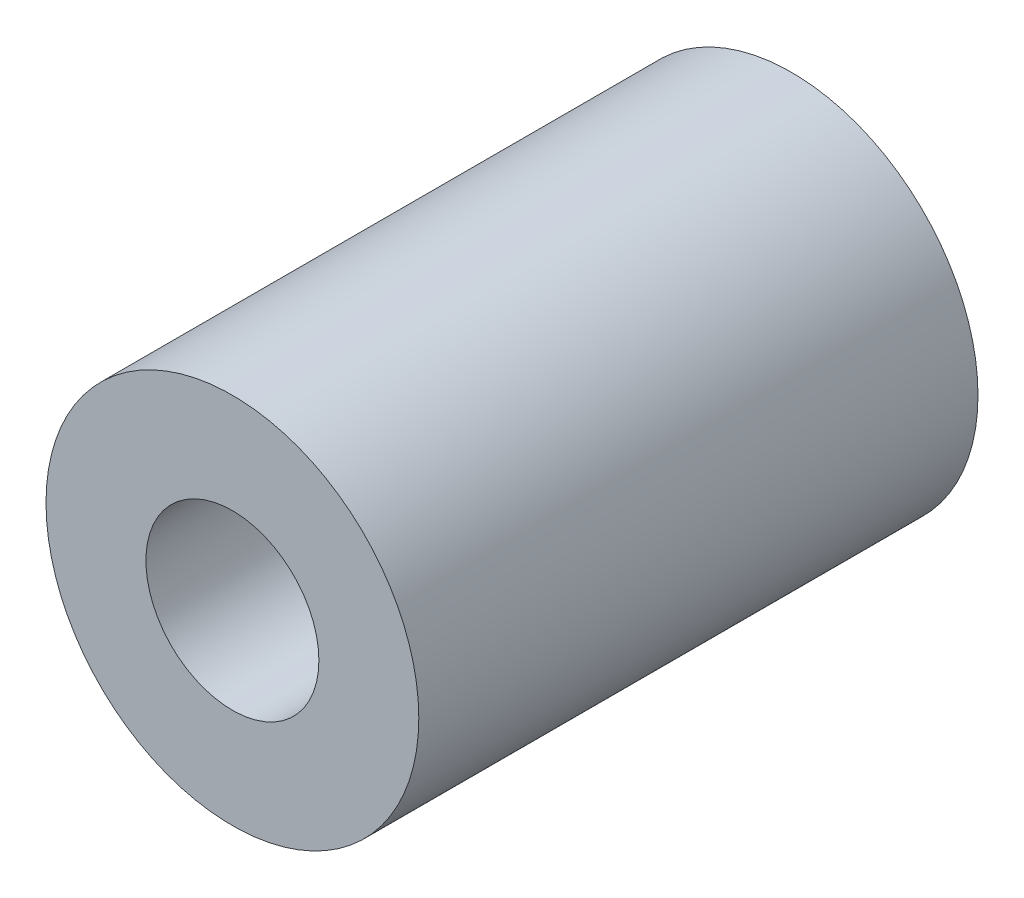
ISO-10303-21;
HEADER;
FILE_DESCRIPTION(('STEP AP214'),'2;1');
FILE_NAME('part.step','',(''),(''),'','','');
FILE_SCHEMA(('AUTOMOTIVE_DESIGN { 1 0 10303 214 1 1 1 1 }'));
ENDSEC;
DATA;
#1=APPLICATION_CONTEXT('core data for automotive mechanical design processes');
#2=APPLICATION_PROTOCOL_DEFINITION('international standard','automotive_design',2000,#1);
#3=PRODUCT_CONTEXT('',#1,'mechanical');
#4=PRODUCT('Part','Part','',(#3));
#5=PRODUCT_RELATED_PRODUCT_CATEGORY('part','',(#4));
#6=PRODUCT_DEFINITION_FORMATION('','',#4);
#7=PRODUCT_DEFINITION_CONTEXT('part definition',#1,'design');
#8=PRODUCT_DEFINITION('design','',#6,#7);
#9=PRODUCT_DEFINITION_SHAPE('','',#8);
#10=(LENGTH_UNIT() NAMED_UNIT(*) SI_UNIT(.MILLI.,.METRE.));
#11=(NAMED_UNIT(*) PLANE_ANGLE_UNIT() SI_UNIT($,.RADIAN.));
#12=(NAMED_UNIT(*) SI_UNIT($,.STERADIAN.) SOLID_ANGLE_UNIT());
#13=UNCERTAINTY_MEASURE_WITH_UNIT(LENGTH_MEASURE(1.E-05),#10,'distance_accuracy_value','');
#14=(GEOMETRIC_REPRESENTATION_CONTEXT(3) GLOBAL_UNCERTAINTY_ASSIGNED_CONTEXT((#13)) GLOBAL_UNIT_ASSIGNED_CONTEXT((#10,
#11,#12)) REPRESENTATION_CONTEXT('',''));
#15=CARTESIAN_POINT('',(0.,0.,0.));
#16=DIRECTION('',(0.,0.,1.));
#17=DIRECTION('',(1.,0.,0.));
#18=AXIS2_PLACEMENT_3D('',#15,#16,#17);
#19=CARTESIAN_POINT('',(0.,0.,9.525));
#20=DIRECTION('',(0.,0.,-1.));
#21=DIRECTION('',(-1.,0.,0.));
#22=AXIS2_PLACEMENT_3D('',#19,#20,#21);
#23=CYLINDRICAL_SURFACE('',#22,3.175);
#24=CARTESIAN_POINT('',(0.,0.,9.525));
#25=DIRECTION('',(0.,0.,1.));
#26=DIRECTION('',(1.,0.,0.));
#27=AXIS2_PLACEMENT_3D('',#24,#25,#26);
#28=CIRCLE('',#27,3.175);
#29=CARTESIAN_POINT('',(-3.175,0.,9.525));
#30=VERTEX_POINT('',#29);
#31=EDGE_CURVE('E10',#30,#30,#28,.T.);
#32=CARTESIAN_POINT('',(0.,0.,0.));
#33=DIRECTION('',(0.,0.,1.));
#34=DIRECTION('',(1.,0.,0.));
#35=AXIS2_PLACEMENT_3D('',#32,#33,#34);
#36=CIRCLE('',#35,3.175);
#37=CARTESIAN_POINT('',(-3.175,0.,0.));
#38=VERTEX_POINT('',#37);
#39=EDGE_CURVE('E34',#38,#38,#36,.T.);
#40=CARTESIAN_POINT('',(-3.175,0.,9.525));
#41=CARTESIAN_POINT('',(-3.175,0.,9.42578125));
#42=CARTESIAN_POINT('',(-3.175,0.,9.3265625));
#43=CARTESIAN_POINT('',(-3.175,0.,9.128125));
#44=CARTESIAN_POINT('',(-3.175,0.,9.02890625));
#45=CARTESIAN_POINT('',(-3.175,0.,8.83046875));
#46=CARTESIAN_POINT('',(-3.175,0.,8.73125));
#47=CARTESIAN_POINT('',(-3.175,0.,8.5328125));
#48=CARTESIAN_POINT('',(-3.175,0.,8.43359375));
#49=CARTESIAN_POINT('',(-3.175,0.,8.23515625));
#50=CARTESIAN_POINT('',(-3.175,0.,8.1359375));
#51=CARTESIAN_POINT('',(-3.175,0.,7.9375));
#52=CARTESIAN_POINT('',(-3.175,0.,7.83828125));
#53=CARTESIAN_POINT('',(-3.175,0.,7.63984375));
#54=CARTESIAN_POINT('',(-3.175,0.,7.540625));
#55=CARTESIAN_POINT('',(-3.175,0.,7.3421875));
#56=CARTESIAN_POINT('',(-3.175,0.,7.24296875));
#57=CARTESIAN_POINT('',(-3.175,0.,7.04453125));
#58=CARTESIAN_POINT('',(-3.175,0.,6.9453125));
#59=CARTESIAN_POINT('',(-3.175,0.,6.746875));
#60=CARTESIAN_POINT('',(-3.175,0.,6.64765625));
#61=CARTESIAN_POINT('',(-3.175,0.,6.44921875));
#62=CARTESIAN_POINT('',(-3.175,0.,6.35));
#63=CARTESIAN_POINT('',(-3.175,0.,6.1515625));
#64=CARTESIAN_POINT('',(-3.175,0.,6.05234375));
#65=CARTESIAN_POINT('',(-3.175,0.,5.85390625));
#66=CARTESIAN_POINT('',(-3.175,0.,5.7546875));
#67=CARTESIAN_POINT('',(-3.175,0.,5.55625));
#68=CARTESIAN_POINT('',(-3.175,0.,5.45703125));
#69=CARTESIAN_POINT('',(-3.175,0.,5.25859375));
#70=CARTESIAN_POINT('',(-3.175,0.,5.159375));
#71=CARTESIAN_POINT('',(-3.175,0.,4.9609375));
#72=CARTESIAN_POINT('',(-3.175,0.,4.86171875));
#73=CARTESIAN_POINT('',(-3.175,0.,4.66328125));
#74=CARTESIAN_POINT('',(-3.175,0.,4.5640625));
#75=CARTESIAN_POINT('',(-3.175,0.,4.365625));
#76=CARTESIAN_POINT('',(-3.175,0.,4.26640625));
#77=CARTESIAN_POINT('',(-3.175,0.,4.06796875));
#78=CARTESIAN_POINT('',(-3.175,0.,3.96875));
#79=CARTESIAN_POINT('',(-3.175,0.,3.7703125));
#80=CARTESIAN_POINT('',(-3.175,0.,3.67109375));
#81=CARTESIAN_POINT('',(-3.175,0.,3.47265625));
#82=CARTESIAN_POINT('',(-3.175,0.,3.3734375));
#83=CARTESIAN_POINT('',(-3.175,0.,3.175));
#84=CARTESIAN_POINT('',(-3.175,0.,3.07578125));
#85=CARTESIAN_POINT('',(-3.175,0.,2.87734375));
#86=CARTESIAN_POINT('',(-3.175,0.,2.778125));
#87=CARTESIAN_POINT('',(-3.175,0.,2.5796875));
#88=CARTESIAN_POINT('',(-3.175,0.,2.48046875));
#89=CARTESIAN_POINT('',(-3.175,0.,2.28203125));
#90=CARTESIAN_POINT('',(-3.175,0.,2.1828125));
#91=CARTESIAN_POINT('',(-3.175,0.,1.984375));
#92=CARTESIAN_POINT('',(-3.175,0.,1.88515625));
#93=CARTESIAN_POINT('',(-3.175,0.,1.68671875));
#94=CARTESIAN_POINT('',(-3.175,0.,1.5875));
#95=CARTESIAN_POINT('',(-3.175,0.,1.3890625));
#96=CARTESIAN_POINT('',(-3.175,0.,1.28984375));
#97=CARTESIAN_POINT('',(-3.175,0.,1.09140625));
#98=CARTESIAN_POINT('',(-3.175,0.,0.992187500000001));
#99=CARTESIAN_POINT('',(-3.175,0.,0.793750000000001));
#100=CARTESIAN_POINT('',(-3.175,0.,0.69453125));
#101=CARTESIAN_POINT('',(-3.175,0.,0.49609375));
#102=CARTESIAN_POINT('',(-3.175,0.,0.396875));
#103=CARTESIAN_POINT('',(-3.175,0.,0.1984375));
#104=CARTESIAN_POINT('',(-3.175,0.,0.0992187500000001));
#105=CARTESIAN_POINT('',(-3.175,0.,0.));
#106=B_SPLINE_CURVE_WITH_KNOTS('',3,(#40,#41,#42,#43,#44,#45,#46,#47,#48,#49,#50,#51,#52,#53,
#54,#55,#56,#57,#58,#59,#60,#61,#62,#63,#64,#65,#66,#67,#68,#69,#70,#71,#72,#73,#74,#75,#76,#77,
#78,#79,#80,#81,#82,#83,#84,#85,#86,#87,#88,#89,#90,#91,#92,#93,#94,#95,#96,#97,#98,#99,#100,
#101,#102,#103,#104,#105),.UNSPECIFIED.,.F.,.F.,(4,2,2,2,2,2,2,2,2,2,2,2,2,2,2,2,2,2,2,2,2,2,2,
2,2,2,2,2,2,2,2,2,4),(0.,0.29765625,0.5953125,0.892968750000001,1.190625,1.48828125,1.7859375,
2.08359375,2.38125,2.67890625,2.9765625,3.27421875,3.571875,3.86953125,4.1671875,4.46484375,
4.7625,5.06015625,5.3578125,5.65546875,5.953125,6.25078125,6.5484375,6.84609375,7.14375,
7.44140625,7.7390625,8.03671875,8.334375,8.63203125,8.9296875,9.22734375,9.525),.UNSPECIFIED.);
#107=EDGE_CURVE('BSEAM31',#30,#38,#106,.T.);
#108=ORIENTED_EDGE('',*,*,#31,.F.);
#109=ORIENTED_EDGE('',*,*,#39,.T.);
#110=ORIENTED_EDGE('',*,*,#107,.T.);
#111=ORIENTED_EDGE('',*,*,#107,.F.);
#112=EDGE_LOOP('',(#108,#110,#109,#111));
#113=FACE_BOUND('',#112,.T.);
#114=ADVANCED_FACE('F31',(#113),#23,.T.);
#115=CARTESIAN_POINT('',(0.,0.,9.525));
#116=DIRECTION('',(0.,0.,1.));
#117=DIRECTION('',(1.,0.,0.));
#118=AXIS2_PLACEMENT_3D('',#115,#116,#117);
#119=PLANE('',#118);
#120=CARTESIAN_POINT('',(0.,0.,9.525));
#121=DIRECTION('',(0.,0.,1.));
#122=DIRECTION('',(1.,0.,0.));
#123=AXIS2_PLACEMENT_3D('',#120,#121,#122);
#124=CIRCLE('',#123,1.47319999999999);
#125=CARTESIAN_POINT('',(1.47319999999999,0.,9.525));
#126=VERTEX_POINT('',#125);
#127=EDGE_CURVE('E45',#126,#126,#124,.T.);
#128=ORIENTED_EDGE('',*,*,#127,.F.);
#129=EDGE_LOOP('',(#128));
#130=FACE_BOUND('',#129,.T.);
#131=ORIENTED_EDGE('',*,*,#31,.T.);
#132=EDGE_LOOP('',(#131));
#133=FACE_BOUND('',#132,.T.);
#134=ADVANCED_FACE('F51',(#130,#133),#119,.T.);
#135=CARTESIAN_POINT('',(0.,0.,0.));
#136=DIRECTION('',(0.,0.,1.));
#137=DIRECTION('',(1.,0.,0.));
#138=AXIS2_PLACEMENT_3D('',#135,#136,#137);
#139=PLANE('',#138);
#140=CARTESIAN_POINT('',(0.,0.,0.));
#141=DIRECTION('',(0.,0.,1.));
#142=DIRECTION('',(1.,0.,0.));
#143=AXIS2_PLACEMENT_3D('',#140,#141,#142);
#144=CIRCLE('',#143,1.4732);
#145=CARTESIAN_POINT('',(1.4732,0.,0.));
#146=VERTEX_POINT('',#145);
#147=EDGE_CURVE('E41',#146,#146,#144,.T.);
#148=ORIENTED_EDGE('',*,*,#147,.T.);
#149=EDGE_LOOP('',(#148));
#150=FACE_BOUND('',#149,.T.);
#151=ORIENTED_EDGE('',*,*,#39,.F.);
#152=EDGE_LOOP('',(#151));
#153=FACE_BOUND('',#152,.T.);
#154=ADVANCED_FACE('F53',(#150,#153),#139,.F.);
#155=CARTESIAN_POINT('',(0.,0.,9.525));
#156=DIRECTION('',(0.,0.,1.));
#157=DIRECTION('',(1.,0.,0.));
#158=AXIS2_PLACEMENT_3D('',#155,#156,#157);
#159=CYLINDRICAL_SURFACE('',#158,1.47319999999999);
#160=ORIENTED_EDGE('',*,*,#147,.F.);
#161=EDGE_LOOP('',(#160));
#162=FACE_BOUND('',#161,.T.);
#163=ORIENTED_EDGE('',*,*,#127,.T.);
#164=EDGE_LOOP('',(#163));
#165=FACE_BOUND('',#164,.T.);
#166=ADVANCED_FACE('F49',(#162,#165),#159,.F.);
#167=CLOSED_SHELL('',(#114,#134,#154,#166));
#168=MANIFOLD_SOLID_BREP('B2',#167);
#169=ADVANCED_BREP_SHAPE_REPRESENTATION('',(#18,#168),#14);
#170=SHAPE_DEFINITION_REPRESENTATION(#9,#169);
ENDSEC;
END-ISO-10303-21;
